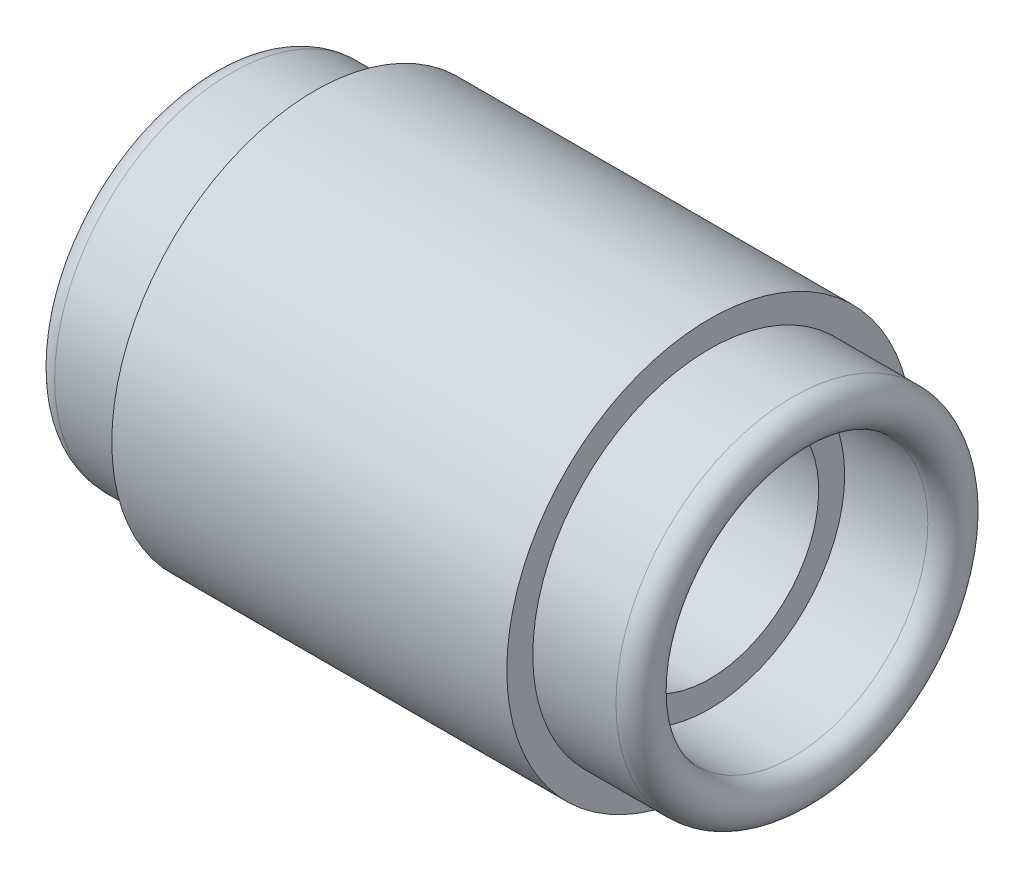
from build123d import *


with BuildPart() as part:
    # Esquisse1 → Base-R_volution (revolve)
    with BuildSketch(Plane.XY, mode=Mode.PRIVATE) as base_r_volution_sk:
        with BuildLine():
            Line((92, 34), (108, 34))
            ThreePointArc((108, 34), (112, 30), (108, 26))
            Line((108, 26), (92, 26))
            Line((92, 26), (92, 21))
            Line((92, 21), (16, 21))
            Line((16, 21), (16, 26))
            Line((16, 26), (0, 26))
            ThreePointArc((0, 26), (-4, 30), (0, 34))
            Line((0, 34), (16, 34))
            Line((16, 34), (16, 39))
            Line((16, 39), (92, 39))
            Line((92, 39), (92, 34))
        make_face()
    revolve(base_r_volution_sk.sketch.rotate(Axis((0, 0, 0), (1, 0, 0)), 90), axis=Axis((0, 0, 0), (1, 0, 0)))


solid = part.part
